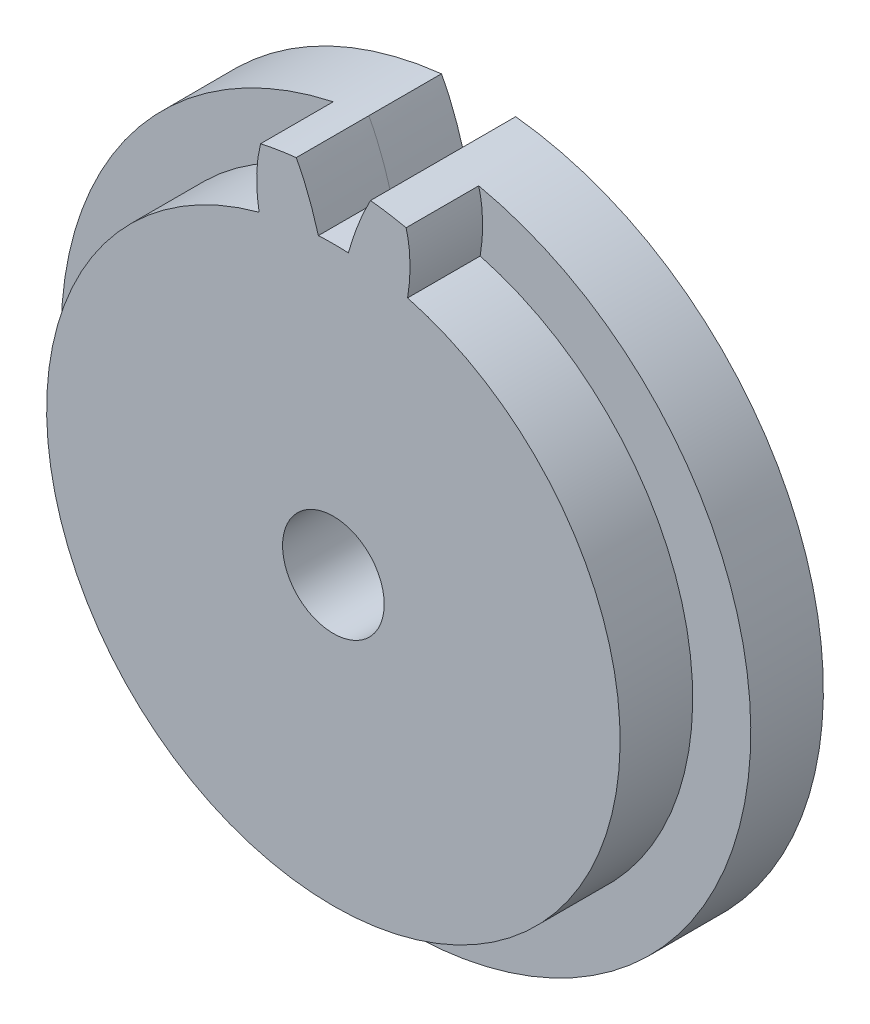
from build123d import *

# Parameters (mm, degrees)
SKETCH_3_R               = 7
EXTRUDE_1_DEPTH          = 10
EXTRUDE_START            = -10
SKETCH_4_R               = 7
EXTRUDE_2_DEPTH          = 10
CUT_EXTRUDE_START        = -10
CUT_EXTRUDE_1_DEPTH      = 10
CUT_EXTRUDE_2_DEPTH      = 72.414284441
CUT_EXTRUDE_2_DEPTH_BACK = 72.414284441
SKETCH_6_R               = 57.5
SKETCH_6_R_2             = 47.5


with BuildPart() as part:
    # Sketch 3 → Extrude 1 (new body)
    with BuildSketch(Plane.XY):
        with BuildLine():
            ThreePointArc((2.067270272, 39.445866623), (0, 39.5), (-2.067270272, 39.445866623))
            add(Edge.make_bspline(
                [(-2.067270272, 39.445866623), (-3.912967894, 45.946293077), (-6.604591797, 49.561874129)],
                knots=[0, 0, 0, 1, 1, 1], degree=2))
            ThreePointArc((-6.604591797, 49.561874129), (-7.821723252, 49.38441703), (-9.034121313, 49.177074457))
            add(Edge.make_bspline(
                [(-10.223352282, 38.154070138), (-11.291537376, 44.374767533), (-9.034121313, 49.177074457)],
                knots=[0, 0, 0, 1, 1, 1], degree=2))
            ThreePointArc((-10.223352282, 38.154070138), (-12.206171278, 37.566732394), (-14.155534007, 36.876426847))
            add(Edge.make_bspline(
                [(-14.155534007, 36.876426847), (-16.9477883, 42.536940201), (-21.596801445, 45.095212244)],
                knots=[0, 0, 0, 1, 1, 1], degree=2))
            ThreePointArc((-21.596801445, 45.095212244), (-22.699524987, 44.550326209), (-23.788511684, 43.978480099))
            add(Edge.make_bspline(
                [(-21.513241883, 33.127487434), (-24.45144749, 38.713634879), (-23.788511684, 43.978480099)],
                knots=[0, 0, 0, 1, 1, 1], degree=2))
            ThreePointArc((-21.513241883, 33.127487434), (-23.217517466, 31.956171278), (-24.858155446, 30.697265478))
            add(Edge.make_bspline(
                [(-24.858155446, 30.697265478), (-29.26294191, 35.217879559), (-34.474965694, 36.214316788)],
                knots=[0, 0, 0, 1, 1, 1], degree=2))
            ThreePointArc((-34.474965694, 36.214316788), (-35.355339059, 35.355339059), (-36.214316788, 34.474965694))
            add(Edge.make_bspline(
                [(-30.697265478, 24.858155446), (-35.217879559, 29.26294191), (-36.214316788, 34.474965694)],
                knots=[0, 0, 0, 1, 1, 1], degree=2))
            ThreePointArc((-30.697265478, 24.858155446), (-31.956171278, 23.217517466), (-33.127487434, 21.513241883))
            add(Edge.make_bspline(
                [(-33.127487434, 21.513241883), (-38.713634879, 24.45144749), (-43.978480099, 23.788511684)],
                knots=[0, 0, 0, 1, 1, 1], degree=2))
            ThreePointArc((-43.978480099, 23.788511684), (-44.550326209, 22.699524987), (-45.095212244, 21.596801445))
            add(Edge.make_bspline(
                [(-36.876426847, 14.155534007), (-42.536940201, 16.9477883), (-45.095212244, 21.596801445)],
                knots=[0, 0, 0, 1, 1, 1], degree=2))
            ThreePointArc((-36.876426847, 14.155534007), (-37.566732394, 12.206171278), (-38.154070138, 10.223352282))
            add(Edge.make_bspline(
                [(-38.154070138, 10.223352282), (-44.374767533, 11.291537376), (-49.177074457, 9.034121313)],
                knots=[0, 0, 0, 1, 1, 1], degree=2))
            ThreePointArc((-49.177074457, 9.034121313), (-49.38441703, 7.821723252), (-49.561874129, 6.604591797))
            add(Edge.make_bspline(
                [(-39.445866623, 2.067270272), (-45.692188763, 2.973667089), (-49.561874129, 6.604591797)],
                knots=[0, 0, 0, 1, 1, 1], degree=2))
            ThreePointArc((-39.445866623, 2.067270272), (-39.5, 0), (-39.445866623, -2.067270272))
            add(Edge.make_bspline(
                [(-39.445866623, -2.067270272), (-45.692188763, -2.973667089), (-49.561874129, -6.604591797)],
                knots=[0, 0, 0, 1, 1, 1], degree=2))
            ThreePointArc((-49.561874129, -6.604591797), (-49.38441703, -7.821723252), (-49.177074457, -9.034121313))
            add(Edge.make_bspline(
                [(-38.154070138, -10.223352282), (-44.374767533, -11.291537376), (-49.177074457, -9.034121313)],
                knots=[0, 0, 0, 1, 1, 1], degree=2))
            ThreePointArc((-38.154070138, -10.223352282), (-37.566732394, -12.206171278), (-36.876426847, -14.155534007))
            add(Edge.make_bspline(
                [(-36.876426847, -14.155534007), (-42.536940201, -16.9477883), (-45.095212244, -21.596801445)],
                knots=[0, 0, 0, 1, 1, 1], degree=2))
            ThreePointArc((-45.095212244, -21.596801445), (-44.550326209, -22.699524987), (-43.978480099, -23.788511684))
            add(Edge.make_bspline(
                [(-33.127487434, -21.513241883), (-38.713634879, -24.45144749), (-43.978480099, -23.788511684)],
                knots=[0, 0, 0, 1, 1, 1], degree=2))
            ThreePointArc((-33.127487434, -21.513241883), (-31.956171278, -23.217517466), (-30.697265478, -24.858155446))
            add(Edge.make_bspline(
                [(-30.697265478, -24.858155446), (-35.217879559, -29.26294191), (-36.214316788, -34.474965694)],
                knots=[0, 0, 0, 1, 1, 1], degree=2))
            ThreePointArc((-36.214316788, -34.474965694), (-35.355339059, -35.355339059), (-34.474965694, -36.214316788))
            add(Edge.make_bspline(
                [(-24.858155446, -30.697265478), (-29.26294191, -35.217879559), (-34.474965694, -36.214316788)],
                knots=[0, 0, 0, 1, 1, 1], degree=2))
            ThreePointArc((-24.858155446, -30.697265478), (-23.217517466, -31.956171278), (-21.513241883, -33.127487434))
            add(Edge.make_bspline(
                [(-21.513241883, -33.127487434), (-24.45144749, -38.713634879), (-23.788511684, -43.978480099)],
                knots=[0, 0, 0, 1, 1, 1], degree=2))
            ThreePointArc((-23.788511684, -43.978480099), (-22.699524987, -44.550326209), (-21.596801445, -45.095212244))
            add(Edge.make_bspline(
                [(-14.155534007, -36.876426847), (-16.9477883, -42.536940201), (-21.596801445, -45.095212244)],
                knots=[0, 0, 0, 1, 1, 1], degree=2))
            ThreePointArc((-14.155534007, -36.876426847), (-12.206171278, -37.566732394), (-10.223352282, -38.154070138))
            add(Edge.make_bspline(
                [(-10.223352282, -38.154070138), (-11.291537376, -44.374767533), (-9.034121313, -49.177074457)],
                knots=[0, 0, 0, 1, 1, 1], degree=2))
            ThreePointArc((-9.034121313, -49.177074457), (-7.821723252, -49.38441703), (-6.604591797, -49.561874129))
            add(Edge.make_bspline(
                [(-2.067270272, -39.445866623), (-2.973667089, -45.692188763), (-6.604591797, -49.561874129)],
                knots=[0, 0, 0, 1, 1, 1], degree=2))
            ThreePointArc((-2.067270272, -39.445866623), (0, -39.5), (2.067270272, -39.445866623))
            add(Edge.make_bspline(
                [(2.067270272, -39.445866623), (2.973667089, -45.692188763), (6.604591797, -49.561874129)],
                knots=[0, 0, 0, 1, 1, 1], degree=2))
            ThreePointArc((6.604591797, -49.561874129), (7.821723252, -49.38441703), (9.034121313, -49.177074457))
            add(Edge.make_bspline(
                [(10.223352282, -38.154070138), (11.291537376, -44.374767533), (9.034121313, -49.177074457)],
                knots=[0, 0, 0, 1, 1, 1], degree=2))
            ThreePointArc((10.223352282, -38.154070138), (12.206171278, -37.566732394), (14.155534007, -36.876426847))
            add(Edge.make_bspline(
                [(14.155534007, -36.876426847), (16.9477883, -42.536940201), (21.596801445, -45.095212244)],
                knots=[0, 0, 0, 1, 1, 1], degree=2))
            ThreePointArc((21.596801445, -45.095212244), (22.699524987, -44.550326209), (23.788511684, -43.978480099))
            add(Edge.make_bspline(
                [(21.513241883, -33.127487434), (24.45144749, -38.713634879), (23.788511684, -43.978480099)],
                knots=[0, 0, 0, 1, 1, 1], degree=2))
            ThreePointArc((21.513241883, -33.127487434), (23.217517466, -31.956171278), (24.858155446, -30.697265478))
            add(Edge.make_bspline(
                [(24.858155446, -30.697265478), (29.26294191, -35.217879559), (34.474965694, -36.214316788)],
                knots=[0, 0, 0, 1, 1, 1], degree=2))
            ThreePointArc((34.474965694, -36.214316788), (35.355339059, -35.355339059), (36.214316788, -34.474965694))
            add(Edge.make_bspline(
                [(30.697265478, -24.858155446), (35.217879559, -29.26294191), (36.214316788, -34.474965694)],
                knots=[0, 0, 0, 1, 1, 1], degree=2))
            ThreePointArc((30.697265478, -24.858155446), (31.956171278, -23.217517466), (33.127487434, -21.513241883))
            add(Edge.make_bspline(
                [(33.127487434, -21.513241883), (38.713634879, -24.45144749), (43.978480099, -23.788511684)],
                knots=[0, 0, 0, 1, 1, 1], degree=2))
            ThreePointArc((43.978480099, -23.788511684), (44.550326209, -22.699524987), (45.095212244, -21.596801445))
            add(Edge.make_bspline(
                [(36.876426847, -14.155534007), (42.536940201, -16.9477883), (45.095212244, -21.596801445)],
                knots=[0, 0, 0, 1, 1, 1], degree=2))
            ThreePointArc((36.876426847, -14.155534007), (37.566732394, -12.206171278), (38.154070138, -10.223352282))
            add(Edge.make_bspline(
                [(38.154070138, -10.223352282), (44.374767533, -11.291537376), (49.177074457, -9.034121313)],
                knots=[0, 0, 0, 1, 1, 1], degree=2))
            ThreePointArc((49.177074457, -9.034121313), (49.38441703, -7.821723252), (49.561874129, -6.604591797))
            add(Edge.make_bspline(
                [(39.445866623, -2.067270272), (45.692188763, -2.973667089), (49.561874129, -6.604591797)],
                knots=[0, 0, 0, 1, 1, 1], degree=2))
            ThreePointArc((39.445866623, -2.067270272), (39.5, 0), (39.445866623, 2.067270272))
            add(Edge.make_bspline(
                [(39.445866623, 2.067270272), (45.692188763, 2.973667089), (49.561874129, 6.604591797)],
                knots=[0, 0, 0, 1, 1, 1], degree=2))
            ThreePointArc((49.561874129, 6.604591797), (49.38441703, 7.821723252), (49.177074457, 9.034121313))
            add(Edge.make_bspline(
                [(38.154070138, 10.223352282), (44.374767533, 11.291537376), (49.177074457, 9.034121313)],
                knots=[0, 0, 0, 1, 1, 1], degree=2))
            ThreePointArc((38.154070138, 10.223352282), (37.566732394, 12.206171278), (36.876426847, 14.155534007))
            add(Edge.make_bspline(
                [(36.876426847, 14.155534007), (42.536940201, 16.9477883), (45.095212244, 21.596801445)],
                knots=[0, 0, 0, 1, 1, 1], degree=2))
            ThreePointArc((45.095212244, 21.596801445), (44.550326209, 22.699524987), (43.978480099, 23.788511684))
            add(Edge.make_bspline(
                [(33.127487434, 21.513241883), (38.713634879, 24.45144749), (43.978480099, 23.788511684)],
                knots=[0, 0, 0, 1, 1, 1], degree=2))
            ThreePointArc((33.127487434, 21.513241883), (31.956171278, 23.217517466), (30.697265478, 24.858155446))
            add(Edge.make_bspline(
                [(30.697265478, 24.858155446), (35.217879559, 29.26294191), (36.214316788, 34.474965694)],
                knots=[0, 0, 0, 1, 1, 1], degree=2))
            ThreePointArc((36.214316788, 34.474965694), (35.355339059, 35.355339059), (34.474965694, 36.214316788))
            add(Edge.make_bspline(
                [(24.858155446, 30.697265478), (29.26294191, 35.217879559), (34.474965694, 36.214316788)],
                knots=[0, 0, 0, 1, 1, 1], degree=2))
            ThreePointArc((24.858155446, 30.697265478), (23.217517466, 31.956171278), (21.513241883, 33.127487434))
            add(Edge.make_bspline(
                [(21.513241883, 33.127487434), (24.45144749, 38.713634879), (23.788511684, 43.978480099)],
                knots=[0, 0, 0, 1, 1, 1], degree=2))
            ThreePointArc((23.788511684, 43.978480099), (22.699524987, 44.550326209), (21.596801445, 45.095212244))
            add(Edge.make_bspline(
                [(14.155534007, 36.876426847), (16.9477883, 42.536940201), (21.596801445, 45.095212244)],
                knots=[0, 0, 0, 1, 1, 1], degree=2))
            ThreePointArc((14.155534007, 36.876426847), (12.206171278, 37.566732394), (10.223352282, 38.154070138))
            add(Edge.make_bspline(
                [(10.223352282, 38.154070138), (11.291537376, 44.374767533), (9.034121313, 49.177074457)],
                knots=[0, 0, 0, 1, 1, 1], degree=2))
            ThreePointArc((9.034121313, 49.177074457), (7.821723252, 49.38441703), (6.604591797, 49.561874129))
            add(Edge.make_bspline(
                [(2.067270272, 39.445866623), (3.912967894, 45.946293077), (6.604591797, 49.561874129)],
                knots=[0, 0, 0, 1, 1, 1], degree=2))
        make_face()
        Circle(SKETCH_3_R, mode=Mode.SUBTRACT)
    extrude(amount=EXTRUDE_1_DEPTH)

    # Sketch 4 → Extrude 2 (add)
    with BuildSketch(Plane.XY.offset(EXTRUDE_START)):
        with BuildLine():
            ThreePointArc((2.067270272, 39.445866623), (0, 39.5), (-2.067270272, 39.445866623))
            add(Edge.make_bspline(
                [(-2.067270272, 39.445866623), (-3.912967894, 45.946293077), (-6.604591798, 49.561874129)],
                knots=[0, 0, 0, 1, 1, 1], degree=2))
            ThreePointArc((-6.604591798, 49.561874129), (0, -50), (6.604591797, 49.561874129))
            add(Edge.make_bspline(
                [(6.604591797, 49.561874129), (3.912967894, 45.946293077), (2.067270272, 39.445866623)],
                knots=[0, 0, 0, 1, 1, 1], degree=2))
        make_face()
        Circle(SKETCH_4_R, mode=Mode.SUBTRACT)
    extrude(amount=EXTRUDE_2_DEPTH)

    # Sketch 5 → Cut-Extrude 1 (cut)
    with BuildSketch(Plane.XY.offset(10).offset(CUT_EXTRUDE_START)):
        with BuildLine():
            ThreePointArc((-14.155534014, 36.876426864), (-17.932624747, 35.194757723), (-21.5132419, 33.127487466))
            add(Edge.make_bspline(
                [(-23.788511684, 43.9784801), (-24.451447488, 38.713634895), (-21.5132419, 33.127487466)],
                knots=[0, 0, 0, 1, 1, 1], degree=2))
            ThreePointArc((-23.788511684, 43.9784801), (-22.699524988, 44.55032621), (-21.596801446, 45.095212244))
            add(Edge.make_bspline(
                [(-14.155534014, 36.876426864), (-16.947788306, 42.536940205), (-21.596801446, 45.095212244)],
                knots=[0, 0, 0, 1, 1, 1], degree=2))
        make_face()
        with BuildLine():
            ThreePointArc((-24.858155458, 30.697265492), (-27.930717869, 27.930717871), (-30.697265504, 24.858155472))
            add(Edge.make_bspline(
                [(-36.214316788, 34.474965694), (-35.217879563, 29.262941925), (-30.697265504, 24.858155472)],
                knots=[0, 0, 0, 1, 1, 1], degree=2))
            ThreePointArc((-36.214316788, 34.474965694), (-35.35533906, 35.35533906), (-34.474965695, 36.214316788))
            add(Edge.make_bspline(
                [(-24.858155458, 30.697265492), (-29.262941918, 35.217879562), (-34.474965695, 36.214316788)],
                knots=[0, 0, 0, 1, 1, 1], degree=2))
        make_face()
        with BuildLine():
            ThreePointArc((-33.12748745, 21.513241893), (-35.194757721, 17.93262475), (-36.876426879, 14.155534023))
            add(Edge.make_bspline(
                [(-45.095212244, 21.596801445), (-42.536940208, 16.947788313), (-36.876426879, 14.155534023)],
                knots=[0, 0, 0, 1, 1, 1], degree=2))
            ThreePointArc((-45.095212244, 21.596801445), (-44.55032621, 22.699524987), (-43.9784801, 23.788511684))
            add(Edge.make_bspline(
                [(-33.12748745, 21.513241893), (-38.713634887, 24.45144749), (-43.9784801, 23.788511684)],
                knots=[0, 0, 0, 1, 1, 1], degree=2))
        make_face()
        with BuildLine():
            ThreePointArc((-38.154070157, 10.223352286), (-39.013689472, 6.179161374), (-39.445866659, 2.067270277))
            add(Edge.make_bspline(
                [(-49.561874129, 6.604591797), (-45.692188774, 2.973667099), (-39.445866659, 2.067270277)],
                knots=[0, 0, 0, 1, 1, 1], degree=2))
            ThreePointArc((-49.561874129, 6.604591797), (-49.38441703, 7.821723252), (-49.177074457, 9.034121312))
            add(Edge.make_bspline(
                [(-38.154070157, 10.223352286), (-44.37476754, 11.291537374), (-49.177074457, 9.034121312)],
                knots=[0, 0, 0, 1, 1, 1], degree=2))
        make_face()
        with BuildLine():
            ThreePointArc((-39.445866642, -2.067270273), (-39.013689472, -6.17916137), (-38.154070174, -10.223352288))
            add(Edge.make_bspline(
                [(-49.177074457, -9.034121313), (-44.374767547, -11.29153737), (-38.154070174, -10.223352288)],
                knots=[0, 0, 0, 1, 1, 1], degree=2))
            ThreePointArc((-49.177074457, -9.034121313), (-49.38441703, -7.821723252), (-49.56187413, -6.604591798))
            add(Edge.make_bspline(
                [(-39.445866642, -2.067270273), (-45.692188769, -2.973667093), (-49.56187413, -6.604591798)],
                knots=[0, 0, 0, 1, 1, 1], degree=2))
        make_face()
        with BuildLine():
            ThreePointArc((-36.876426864, -14.155534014), (-35.194757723, -17.932624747), (-33.127487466, -21.5132419))
            add(Edge.make_bspline(
                [(-43.9784801, -23.788511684), (-38.713634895, -24.451447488), (-33.127487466, -21.5132419)],
                knots=[0, 0, 0, 1, 1, 1], degree=2))
            ThreePointArc((-43.9784801, -23.788511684), (-44.55032621, -22.699524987), (-45.095212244, -21.596801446))
            add(Edge.make_bspline(
                [(-36.876426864, -14.155534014), (-42.536940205, -16.947788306), (-45.095212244, -21.596801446)],
                knots=[0, 0, 0, 1, 1, 1], degree=2))
        make_face()
        with BuildLine():
            ThreePointArc((-30.697265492, -24.858155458), (-27.930717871, -27.930717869), (-24.858155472, -30.697265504))
            add(Edge.make_bspline(
                [(-34.474965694, -36.214316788), (-29.262941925, -35.217879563), (-24.858155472, -30.697265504)],
                knots=[0, 0, 0, 1, 1, 1], degree=2))
            ThreePointArc((-34.474965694, -36.214316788), (-35.35533906, -35.35533906), (-36.214316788, -34.474965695))
            add(Edge.make_bspline(
                [(-30.697265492, -24.858155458), (-35.217879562, -29.262941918), (-36.214316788, -34.474965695)],
                knots=[0, 0, 0, 1, 1, 1], degree=2))
        make_face()
        with BuildLine():
            ThreePointArc((-21.513241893, -33.12748745), (-17.93262475, -35.194757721), (-14.155534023, -36.876426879))
            add(Edge.make_bspline(
                [(-21.596801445, -45.095212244), (-16.947788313, -42.536940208), (-14.155534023, -36.876426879)],
                knots=[0, 0, 0, 1, 1, 1], degree=2))
            ThreePointArc((-21.596801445, -45.095212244), (-22.699524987, -44.55032621), (-23.788511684, -43.9784801))
            add(Edge.make_bspline(
                [(-21.513241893, -33.12748745), (-24.45144749, -38.713634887), (-23.788511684, -43.9784801)],
                knots=[0, 0, 0, 1, 1, 1], degree=2))
        make_face()
        with BuildLine():
            ThreePointArc((-10.223352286, -38.154070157), (-6.179161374, -39.013689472), (-2.067270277, -39.445866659))
            add(Edge.make_bspline(
                [(-6.604591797, -49.561874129), (-2.973667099, -45.692188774), (-2.067270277, -39.445866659)],
                knots=[0, 0, 0, 1, 1, 1], degree=2))
            ThreePointArc((-6.604591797, -49.561874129), (-7.821723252, -49.38441703), (-9.034121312, -49.177074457))
            add(Edge.make_bspline(
                [(-10.223352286, -38.154070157), (-11.291537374, -44.37476754), (-9.034121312, -49.177074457)],
                knots=[0, 0, 0, 1, 1, 1], degree=2))
        make_face()
        with BuildLine():
            ThreePointArc((2.067270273, -39.445866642), (6.17916137, -39.013689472), (10.223352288, -38.154070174))
            add(Edge.make_bspline(
                [(9.034121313, -49.177074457), (11.29153737, -44.374767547), (10.223352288, -38.154070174)],
                knots=[0, 0, 0, 1, 1, 1], degree=2))
            ThreePointArc((9.034121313, -49.177074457), (7.821723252, -49.38441703), (6.604591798, -49.56187413))
            add(Edge.make_bspline(
                [(2.067270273, -39.445866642), (2.973667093, -45.692188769), (6.604591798, -49.56187413)],
                knots=[0, 0, 0, 1, 1, 1], degree=2))
        make_face()
        with BuildLine():
            ThreePointArc((14.155534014, -36.876426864), (17.932624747, -35.194757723), (21.5132419, -33.127487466))
            add(Edge.make_bspline(
                [(23.788511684, -43.9784801), (24.451447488, -38.713634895), (21.5132419, -33.127487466)],
                knots=[0, 0, 0, 1, 1, 1], degree=2))
            ThreePointArc((23.788511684, -43.9784801), (22.699524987, -44.55032621), (21.596801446, -45.095212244))
            add(Edge.make_bspline(
                [(14.155534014, -36.876426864), (16.947788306, -42.536940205), (21.596801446, -45.095212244)],
                knots=[0, 0, 0, 1, 1, 1], degree=2))
        make_face()
        with BuildLine():
            ThreePointArc((24.858155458, -30.697265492), (27.930717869, -27.930717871), (30.697265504, -24.858155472))
            add(Edge.make_bspline(
                [(36.214316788, -34.474965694), (35.217879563, -29.262941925), (30.697265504, -24.858155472)],
                knots=[0, 0, 0, 1, 1, 1], degree=2))
            ThreePointArc((36.214316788, -34.474965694), (35.35533906, -35.35533906), (34.474965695, -36.214316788))
            add(Edge.make_bspline(
                [(24.858155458, -30.697265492), (29.262941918, -35.217879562), (34.474965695, -36.214316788)],
                knots=[0, 0, 0, 1, 1, 1], degree=2))
        make_face()
        with BuildLine():
            ThreePointArc((33.12748745, -21.513241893), (35.194757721, -17.93262475), (36.876426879, -14.155534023))
            add(Edge.make_bspline(
                [(45.095212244, -21.596801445), (42.536940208, -16.947788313), (36.876426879, -14.155534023)],
                knots=[0, 0, 0, 1, 1, 1], degree=2))
            ThreePointArc((45.095212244, -21.596801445), (44.55032621, -22.699524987), (43.9784801, -23.788511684))
            add(Edge.make_bspline(
                [(33.12748745, -21.513241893), (38.713634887, -24.45144749), (43.9784801, -23.788511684)],
                knots=[0, 0, 0, 1, 1, 1], degree=2))
        make_face()
        with BuildLine():
            ThreePointArc((38.154070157, -10.223352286), (39.013689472, -6.179161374), (39.445866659, -2.067270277))
            add(Edge.make_bspline(
                [(49.561874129, -6.604591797), (45.692188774, -2.973667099), (39.445866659, -2.067270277)],
                knots=[0, 0, 0, 1, 1, 1], degree=2))
            ThreePointArc((49.561874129, -6.604591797), (49.38441703, -7.821723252), (49.177074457, -9.034121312))
            add(Edge.make_bspline(
                [(38.154070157, -10.223352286), (44.37476754, -11.291537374), (49.177074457, -9.034121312)],
                knots=[0, 0, 0, 1, 1, 1], degree=2))
        make_face()
        with BuildLine():
            ThreePointArc((39.445866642, 2.067270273), (39.013689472, 6.17916137), (38.154070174, 10.223352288))
            add(Edge.make_bspline(
                [(49.177074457, 9.034121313), (44.374767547, 11.29153737), (38.154070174, 10.223352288)],
                knots=[0, 0, 0, 1, 1, 1], degree=2))
            ThreePointArc((49.177074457, 9.034121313), (49.38441703, 7.821723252), (49.56187413, 6.604591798))
            add(Edge.make_bspline(
                [(39.445866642, 2.067270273), (45.692188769, 2.973667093), (49.56187413, 6.604591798)],
                knots=[0, 0, 0, 1, 1, 1], degree=2))
        make_face()
        with BuildLine():
            ThreePointArc((36.876426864, 14.155534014), (35.194757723, 17.932624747), (33.127487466, 21.5132419))
            add(Edge.make_bspline(
                [(43.9784801, 23.788511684), (38.713634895, 24.451447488), (33.127487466, 21.5132419)],
                knots=[0, 0, 0, 1, 1, 1], degree=2))
            ThreePointArc((43.9784801, 23.788511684), (44.55032621, 22.699524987), (45.095212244, 21.596801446))
            add(Edge.make_bspline(
                [(36.876426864, 14.155534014), (42.536940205, 16.947788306), (45.095212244, 21.596801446)],
                knots=[0, 0, 0, 1, 1, 1], degree=2))
        make_face()
        with BuildLine():
            ThreePointArc((30.697265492, 24.858155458), (27.930717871, 27.930717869), (24.858155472, 30.697265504))
            add(Edge.make_bspline(
                [(34.474965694, 36.214316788), (29.262941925, 35.217879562), (24.858155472, 30.697265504)],
                knots=[0, 0, 0, 1, 1, 1], degree=2))
            ThreePointArc((34.474965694, 36.214316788), (35.355339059, 35.35533906), (36.214316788, 34.474965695))
            add(Edge.make_bspline(
                [(30.697265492, 24.858155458), (35.217879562, 29.262941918), (36.214316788, 34.474965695)],
                knots=[0, 0, 0, 1, 1, 1], degree=2))
        make_face()
        with BuildLine():
            ThreePointArc((21.513241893, 33.12748745), (17.93262475, 35.194757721), (14.155534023, 36.876426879))
            add(Edge.make_bspline(
                [(21.596801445, 45.095212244), (16.947788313, 42.536940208), (14.155534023, 36.876426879)],
                knots=[0, 0, 0, 1, 1, 1], degree=2))
            ThreePointArc((21.596801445, 45.095212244), (22.699524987, 44.55032621), (23.788511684, 43.9784801))
            add(Edge.make_bspline(
                [(21.513241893, 33.12748745), (24.45144749, 38.713634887), (23.788511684, 43.9784801)],
                knots=[0, 0, 0, 1, 1, 1], degree=2))
        make_face()
    extrude(amount=CUT_EXTRUDE_1_DEPTH, mode=Mode.SUBTRACT)

    # Sketch 6 → Cut-Extrude 2 (cut, two sides: drawn at the far end of the back side and taken through both)
    with BuildSketch(Plane.XY.offset(-CUT_EXTRUDE_2_DEPTH_BACK)):
        Circle(SKETCH_6_R)
        Circle(SKETCH_6_R_2, mode=Mode.SUBTRACT)
    extrude(amount=CUT_EXTRUDE_2_DEPTH + CUT_EXTRUDE_2_DEPTH_BACK, mode=Mode.SUBTRACT)


solid = part.part
